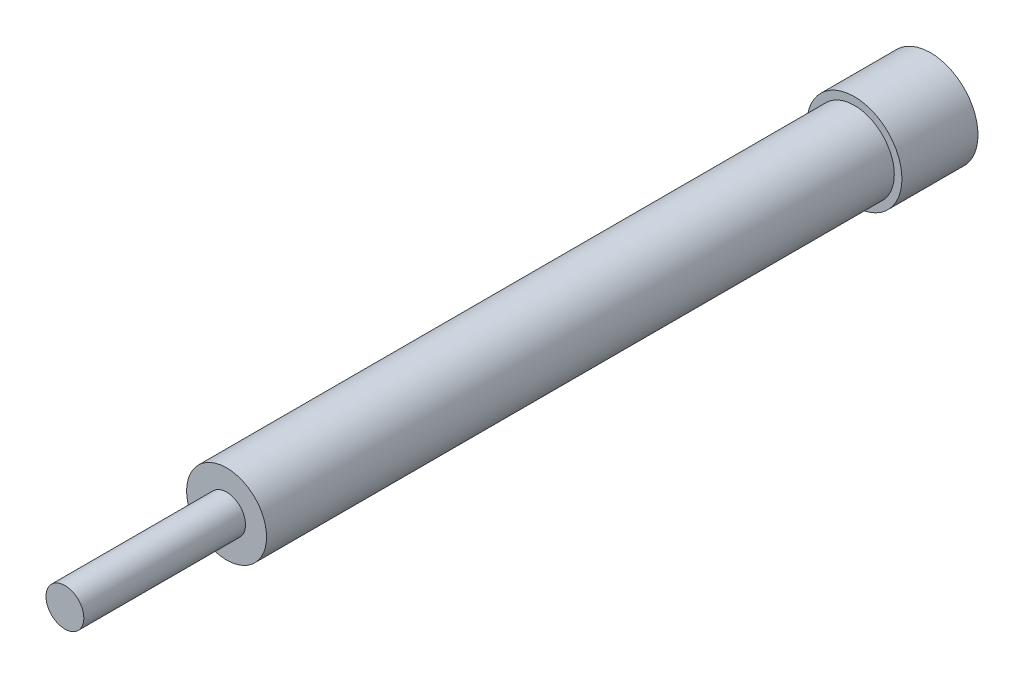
ISO-10303-21;
HEADER;
FILE_DESCRIPTION(('STEP AP214'),'2;1');
FILE_NAME('part.step','',(''),(''),'','','');
FILE_SCHEMA(('AUTOMOTIVE_DESIGN { 1 0 10303 214 1 1 1 1 }'));
ENDSEC;
DATA;
#1=APPLICATION_CONTEXT('core data for automotive mechanical design processes');
#2=APPLICATION_PROTOCOL_DEFINITION('international standard','automotive_design',2000,#1);
#3=PRODUCT_CONTEXT('',#1,'mechanical');
#4=PRODUCT('Part','Part','',(#3));
#5=PRODUCT_RELATED_PRODUCT_CATEGORY('part','',(#4));
#6=PRODUCT_DEFINITION_FORMATION('','',#4);
#7=PRODUCT_DEFINITION_CONTEXT('part definition',#1,'design');
#8=PRODUCT_DEFINITION('design','',#6,#7);
#9=PRODUCT_DEFINITION_SHAPE('','',#8);
#10=(LENGTH_UNIT() NAMED_UNIT(*) SI_UNIT(.MILLI.,.METRE.));
#11=(NAMED_UNIT(*) PLANE_ANGLE_UNIT() SI_UNIT($,.RADIAN.));
#12=(NAMED_UNIT(*) SI_UNIT($,.STERADIAN.) SOLID_ANGLE_UNIT());
#13=UNCERTAINTY_MEASURE_WITH_UNIT(LENGTH_MEASURE(1.E-05),#10,'distance_accuracy_value','');
#14=(GEOMETRIC_REPRESENTATION_CONTEXT(3) GLOBAL_UNCERTAINTY_ASSIGNED_CONTEXT((#13)) GLOBAL_UNIT_ASSIGNED_CONTEXT((#10,
#11,#12)) REPRESENTATION_CONTEXT('',''));
#15=CARTESIAN_POINT('',(0.,0.,0.));
#16=DIRECTION('',(0.,0.,1.));
#17=DIRECTION('',(1.,0.,0.));
#18=AXIS2_PLACEMENT_3D('',#15,#16,#17);
#19=CARTESIAN_POINT('',(0.,0.,330.));
#20=DIRECTION('',(0.,0.,1.));
#21=DIRECTION('',(1.,0.,0.));
#22=AXIS2_PLACEMENT_3D('',#19,#20,#21);
#23=PLANE('',#22);
#24=CARTESIAN_POINT('',(0.,0.,330.));
#25=DIRECTION('',(0.,0.,1.));
#26=DIRECTION('',(1.,0.,0.));
#27=AXIS2_PLACEMENT_3D('',#24,#25,#26);
#28=CIRCLE('',#27,21.);
#29=CARTESIAN_POINT('',(21.,0.,330.));
#30=VERTEX_POINT('',#29);
#31=EDGE_CURVE('E47',#30,#30,#28,.T.);
#32=ORIENTED_EDGE('',*,*,#31,.T.);
#33=EDGE_LOOP('',(#32));
#34=FACE_BOUND('',#33,.T.);
#35=CARTESIAN_POINT('',(0.,0.,330.));
#36=DIRECTION('',(0.,0.,1.));
#37=DIRECTION('',(1.,0.,0.));
#38=AXIS2_PLACEMENT_3D('',#35,#36,#37);
#39=CIRCLE('',#38,9.95);
#40=CARTESIAN_POINT('',(9.95,0.,330.));
#41=VERTEX_POINT('',#40);
#42=EDGE_CURVE('E59',#41,#41,#39,.T.);
#43=ORIENTED_EDGE('',*,*,#42,.F.);
#44=EDGE_LOOP('',(#43));
#45=FACE_BOUND('',#44,.T.);
#46=ADVANCED_FACE('F36',(#34,#45),#23,.T.);
#47=CARTESIAN_POINT('',(0.,0.,0.));
#48=DIRECTION('',(0.,0.,1.));
#49=DIRECTION('',(1.,0.,0.));
#50=AXIS2_PLACEMENT_3D('',#47,#48,#49);
#51=PLANE('',#50);
#52=CARTESIAN_POINT('',(0.,0.,0.));
#53=DIRECTION('',(0.,0.,1.));
#54=DIRECTION('',(1.,0.,0.));
#55=AXIS2_PLACEMENT_3D('',#52,#53,#54);
#56=CIRCLE('',#55,25.);
#57=CARTESIAN_POINT('',(25.,0.,0.));
#58=VERTEX_POINT('',#57);
#59=EDGE_CURVE('E43',#58,#58,#56,.T.);
#60=ORIENTED_EDGE('',*,*,#59,.T.);
#61=EDGE_LOOP('',(#60));
#62=FACE_BOUND('',#61,.T.);
#63=CARTESIAN_POINT('',(0.,0.,0.));
#64=DIRECTION('',(0.,0.,1.));
#65=DIRECTION('',(1.,0.,0.));
#66=AXIS2_PLACEMENT_3D('',#63,#64,#65);
#67=CIRCLE('',#66,21.);
#68=CARTESIAN_POINT('',(21.,0.,0.));
#69=VERTEX_POINT('',#68);
#70=EDGE_CURVE('E51',#69,#69,#67,.T.);
#71=ORIENTED_EDGE('',*,*,#70,.F.);
#72=EDGE_LOOP('',(#71));
#73=FACE_BOUND('',#72,.T.);
#74=ADVANCED_FACE('F66',(#62,#73),#51,.T.);
#75=CARTESIAN_POINT('',(0.,0.,-40.));
#76=DIRECTION('',(0.,0.,1.));
#77=DIRECTION('',(1.,0.,0.));
#78=AXIS2_PLACEMENT_3D('',#75,#76,#77);
#79=CYLINDRICAL_SURFACE('',#78,25.);
#80=CARTESIAN_POINT('',(0.,0.,-40.));
#81=DIRECTION('',(0.,0.,1.));
#82=DIRECTION('',(1.,0.,0.));
#83=AXIS2_PLACEMENT_3D('',#80,#81,#82);
#84=CIRCLE('',#83,25.);
#85=CARTESIAN_POINT('',(25.,0.,-40.));
#86=VERTEX_POINT('',#85);
#87=EDGE_CURVE('E10',#86,#86,#84,.T.);
#88=ORIENTED_EDGE('',*,*,#87,.T.);
#89=EDGE_LOOP('',(#88));
#90=FACE_BOUND('',#89,.T.);
#91=ORIENTED_EDGE('',*,*,#59,.F.);
#92=EDGE_LOOP('',(#91));
#93=FACE_BOUND('',#92,.T.);
#94=ADVANCED_FACE('F38',(#90,#93),#79,.T.);
#95=CARTESIAN_POINT('',(0.,0.,-40.));
#96=DIRECTION('',(0.,0.,1.));
#97=DIRECTION('',(1.,0.,0.));
#98=AXIS2_PLACEMENT_3D('',#95,#96,#97);
#99=PLANE('',#98);
#100=ORIENTED_EDGE('',*,*,#87,.F.);
#101=EDGE_LOOP('',(#100));
#102=FACE_BOUND('',#101,.T.);
#103=ADVANCED_FACE('F78',(#102),#99,.F.);
#104=CARTESIAN_POINT('',(0.,0.,330.));
#105=DIRECTION('',(0.,0.,-1.));
#106=DIRECTION('',(-1.,0.,0.));
#107=AXIS2_PLACEMENT_3D('',#104,#105,#106);
#108=CYLINDRICAL_SURFACE('',#107,21.);
#109=ORIENTED_EDGE('',*,*,#31,.F.);
#110=EDGE_LOOP('',(#109));
#111=FACE_BOUND('',#110,.T.);
#112=ORIENTED_EDGE('',*,*,#70,.T.);
#113=EDGE_LOOP('',(#112));
#114=FACE_BOUND('',#113,.T.);
#115=ADVANCED_FACE('F76',(#111,#114),#108,.T.);
#116=CARTESIAN_POINT('',(0.,0.,415.));
#117=DIRECTION('',(0.,0.,-1.));
#118=DIRECTION('',(-1.,0.,0.));
#119=AXIS2_PLACEMENT_3D('',#116,#117,#118);
#120=CYLINDRICAL_SURFACE('',#119,9.95);
#121=CARTESIAN_POINT('',(0.,0.,415.));
#122=DIRECTION('',(0.,0.,1.));
#123=DIRECTION('',(1.,0.,0.));
#124=AXIS2_PLACEMENT_3D('',#121,#122,#123);
#125=CIRCLE('',#124,9.95);
#126=CARTESIAN_POINT('',(9.95,0.,415.));
#127=VERTEX_POINT('',#126);
#128=EDGE_CURVE('E56',#127,#127,#125,.T.);
#129=ORIENTED_EDGE('',*,*,#128,.F.);
#130=EDGE_LOOP('',(#129));
#131=FACE_BOUND('',#130,.T.);
#132=ORIENTED_EDGE('',*,*,#42,.T.);
#133=EDGE_LOOP('',(#132));
#134=FACE_BOUND('',#133,.T.);
#135=ADVANCED_FACE('F63',(#131,#134),#120,.T.);
#136=CARTESIAN_POINT('',(0.,0.,415.));
#137=DIRECTION('',(0.,0.,1.));
#138=DIRECTION('',(1.,0.,0.));
#139=AXIS2_PLACEMENT_3D('',#136,#137,#138);
#140=PLANE('',#139);
#141=ORIENTED_EDGE('',*,*,#128,.T.);
#142=EDGE_LOOP('',(#141));
#143=FACE_BOUND('',#142,.T.);
#144=ADVANCED_FACE('F132',(#143),#140,.T.);
#145=CLOSED_SHELL('',(#46,#74,#94,#103,#115,#135,#144));
#146=MANIFOLD_SOLID_BREP('B2',#145);
#147=ADVANCED_BREP_SHAPE_REPRESENTATION('',(#18,#146),#14);
#148=SHAPE_DEFINITION_REPRESENTATION(#9,#147);
ENDSEC;
END-ISO-10303-21;
